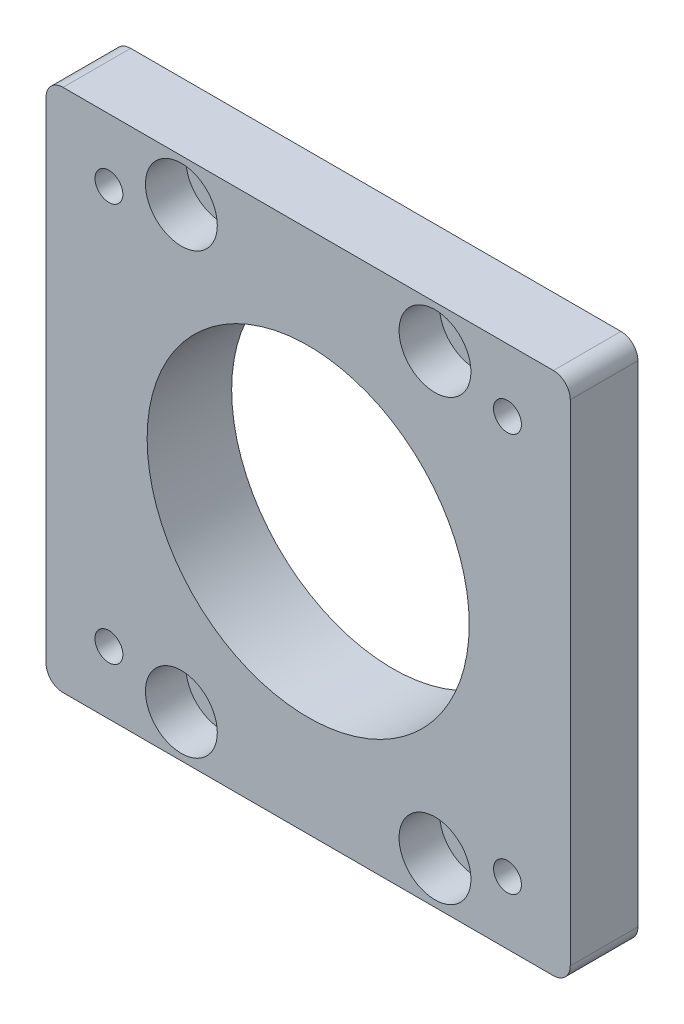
ISO-10303-21;
HEADER;
FILE_DESCRIPTION(('STEP AP214'),'2;1');
FILE_NAME('part.step','',(''),(''),'','','');
FILE_SCHEMA(('AUTOMOTIVE_DESIGN { 1 0 10303 214 1 1 1 1 }'));
ENDSEC;
DATA;
#1=APPLICATION_CONTEXT('core data for automotive mechanical design processes');
#2=APPLICATION_PROTOCOL_DEFINITION('international standard','automotive_design',2000,#1);
#3=PRODUCT_CONTEXT('',#1,'mechanical');
#4=PRODUCT('Part','Part','',(#3));
#5=PRODUCT_RELATED_PRODUCT_CATEGORY('part','',(#4));
#6=PRODUCT_DEFINITION_FORMATION('','',#4);
#7=PRODUCT_DEFINITION_CONTEXT('part definition',#1,'design');
#8=PRODUCT_DEFINITION('design','',#6,#7);
#9=PRODUCT_DEFINITION_SHAPE('','',#8);
#10=(LENGTH_UNIT() NAMED_UNIT(*) SI_UNIT(.MILLI.,.METRE.));
#11=(NAMED_UNIT(*) PLANE_ANGLE_UNIT() SI_UNIT($,.RADIAN.));
#12=(NAMED_UNIT(*) SI_UNIT($,.STERADIAN.) SOLID_ANGLE_UNIT());
#13=UNCERTAINTY_MEASURE_WITH_UNIT(LENGTH_MEASURE(1.E-05),#10,'distance_accuracy_value','');
#14=(GEOMETRIC_REPRESENTATION_CONTEXT(3) GLOBAL_UNCERTAINTY_ASSIGNED_CONTEXT((#13)) GLOBAL_UNIT_ASSIGNED_CONTEXT((#10,
#11,#12)) REPRESENTATION_CONTEXT('',''));
#15=CARTESIAN_POINT('',(0.,0.,0.));
#16=DIRECTION('',(0.,0.,1.));
#17=DIRECTION('',(1.,0.,0.));
#18=AXIS2_PLACEMENT_3D('',#15,#16,#17);
#19=CARTESIAN_POINT('',(0.,0.,0.));
#20=DIRECTION('',(0.,0.,-1.));
#21=DIRECTION('',(-1.,0.,0.));
#22=AXIS2_PLACEMENT_3D('',#19,#20,#21);
#23=PLANE('',#22);
#24=CARTESIAN_POINT('',(-23.5714045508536,23.5714045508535,0.));
#25=DIRECTION('',(0.,0.,-1.));
#26=DIRECTION('',(-1.,0.,0.));
#27=AXIS2_PLACEMENT_3D('',#24,#25,#26);
#28=CIRCLE('',#27,1.64999999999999);
#29=CARTESIAN_POINT('',(-25.2214045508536,23.5714045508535,0.));
#30=VERTEX_POINT('',#29);
#31=EDGE_CURVE('E452',#30,#30,#28,.T.);
#32=ORIENTED_EDGE('',*,*,#31,.F.);
#33=EDGE_LOOP('',(#32));
#34=FACE_BOUND('',#33,.T.);
#35=CARTESIAN_POINT('',(-23.5714045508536,-23.5714045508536,0.));
#36=DIRECTION('',(0.,0.,-1.));
#37=DIRECTION('',(-1.,0.,0.));
#38=AXIS2_PLACEMENT_3D('',#35,#36,#37);
#39=CIRCLE('',#38,1.64999999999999);
#40=CARTESIAN_POINT('',(-25.2214045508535,-23.5714045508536,0.));
#41=VERTEX_POINT('',#40);
#42=EDGE_CURVE('E44',#41,#41,#39,.T.);
#43=ORIENTED_EDGE('',*,*,#42,.F.);
#44=EDGE_LOOP('',(#43));
#45=FACE_BOUND('',#44,.T.);
#46=CARTESIAN_POINT('',(23.5714045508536,-23.5714045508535,0.));
#47=DIRECTION('',(0.,0.,-1.));
#48=DIRECTION('',(-1.,0.,0.));
#49=AXIS2_PLACEMENT_3D('',#46,#47,#48);
#50=CIRCLE('',#49,1.64999999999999);
#51=CARTESIAN_POINT('',(21.9214045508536,-23.5714045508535,0.));
#52=VERTEX_POINT('',#51);
#53=EDGE_CURVE('E207',#52,#52,#50,.T.);
#54=ORIENTED_EDGE('',*,*,#53,.F.);
#55=EDGE_LOOP('',(#54));
#56=FACE_BOUND('',#55,.T.);
#57=CARTESIAN_POINT('',(23.5714045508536,23.5714045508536,0.));
#58=DIRECTION('',(0.,0.,-1.));
#59=DIRECTION('',(-1.,0.,0.));
#60=AXIS2_PLACEMENT_3D('',#57,#58,#59);
#61=CIRCLE('',#60,1.64999999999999);
#62=CARTESIAN_POINT('',(21.9214045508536,23.5714045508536,0.));
#63=VERTEX_POINT('',#62);
#64=EDGE_CURVE('E217',#63,#63,#61,.T.);
#65=ORIENTED_EDGE('',*,*,#64,.F.);
#66=EDGE_LOOP('',(#65));
#67=FACE_BOUND('',#66,.T.);
#68=DIRECTION('',(0.,-1.,0.));
#69=VECTOR('',#68,1.);
#70=CARTESIAN_POINT('',(-31.,-31.,0.));
#71=LINE('',#70,#69);
#72=CARTESIAN_POINT('',(-31.,29.,0.));
#73=VERTEX_POINT('',#72);
#74=CARTESIAN_POINT('',(-31.,-29.,0.));
#75=VERTEX_POINT('',#74);
#76=EDGE_CURVE('E128',#73,#75,#71,.T.);
#77=ORIENTED_EDGE('',*,*,#76,.F.);
#78=CARTESIAN_POINT('',(-29.,29.,0.));
#79=DIRECTION('',(0.,0.,-1.));
#80=DIRECTION('',(-1.,0.,0.));
#81=AXIS2_PLACEMENT_3D('',#78,#79,#80);
#82=CIRCLE('',#81,2.);
#83=CARTESIAN_POINT('',(-29.,31.,0.));
#84=VERTEX_POINT('',#83);
#85=EDGE_CURVE('E110',#73,#84,#82,.T.);
#86=ORIENTED_EDGE('',*,*,#85,.T.);
#87=DIRECTION('',(-1.,0.,0.));
#88=VECTOR('',#87,1.);
#89=CARTESIAN_POINT('',(-31.,31.,0.));
#90=LINE('',#89,#88);
#91=CARTESIAN_POINT('',(29.,31.,0.));
#92=VERTEX_POINT('',#91);
#93=EDGE_CURVE('E139',#92,#84,#90,.T.);
#94=ORIENTED_EDGE('',*,*,#93,.F.);
#95=CARTESIAN_POINT('',(29.,29.,0.));
#96=DIRECTION('',(0.,0.,-1.));
#97=DIRECTION('',(-1.,0.,0.));
#98=AXIS2_PLACEMENT_3D('',#95,#96,#97);
#99=CIRCLE('',#98,2.);
#100=CARTESIAN_POINT('',(31.,29.,0.));
#101=VERTEX_POINT('',#100);
#102=EDGE_CURVE('E132',#92,#101,#99,.T.);
#103=ORIENTED_EDGE('',*,*,#102,.T.);
#104=DIRECTION('',(0.,1.,0.));
#105=VECTOR('',#104,1.);
#106=CARTESIAN_POINT('',(31.,-31.,0.));
#107=LINE('',#106,#105);
#108=CARTESIAN_POINT('',(31.,-29.,0.));
#109=VERTEX_POINT('',#108);
#110=EDGE_CURVE('E147',#109,#101,#107,.T.);
#111=ORIENTED_EDGE('',*,*,#110,.F.);
#112=CARTESIAN_POINT('',(29.,-29.,0.));
#113=DIRECTION('',(0.,0.,-1.));
#114=DIRECTION('',(-1.,0.,0.));
#115=AXIS2_PLACEMENT_3D('',#112,#113,#114);
#116=CIRCLE('',#115,2.);
#117=CARTESIAN_POINT('',(29.,-31.,0.));
#118=VERTEX_POINT('',#117);
#119=EDGE_CURVE('E179',#109,#118,#116,.T.);
#120=ORIENTED_EDGE('',*,*,#119,.T.);
#121=DIRECTION('',(1.,0.,0.));
#122=VECTOR('',#121,1.);
#123=CARTESIAN_POINT('',(-31.,-31.,0.));
#124=LINE('',#123,#122);
#125=CARTESIAN_POINT('',(-29.,-31.,0.));
#126=VERTEX_POINT('',#125);
#127=EDGE_CURVE('E138',#126,#118,#124,.T.);
#128=ORIENTED_EDGE('',*,*,#127,.F.);
#129=CARTESIAN_POINT('',(-29.,-29.,0.));
#130=DIRECTION('',(0.,0.,-1.));
#131=DIRECTION('',(-1.,0.,0.));
#132=AXIS2_PLACEMENT_3D('',#129,#130,#131);
#133=CIRCLE('',#132,2.);
#134=EDGE_CURVE('E122',#126,#75,#133,.T.);
#135=ORIENTED_EDGE('',*,*,#134,.T.);
#136=EDGE_LOOP('',(#77,#86,#94,#103,#111,#120,#128,#135));
#137=FACE_BOUND('',#136,.T.);
#138=CARTESIAN_POINT('',(-15.,25.9807621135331,0.));
#139=DIRECTION('',(0.,0.,1.));
#140=DIRECTION('',(1.,0.,0.));
#141=AXIS2_PLACEMENT_3D('',#138,#139,#140);
#142=CIRCLE('',#141,2.25);
#143=CARTESIAN_POINT('',(-12.75,25.9807621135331,0.));
#144=VERTEX_POINT('',#143);
#145=EDGE_CURVE('E279',#144,#144,#142,.T.);
#146=ORIENTED_EDGE('',*,*,#145,.T.);
#147=EDGE_LOOP('',(#146));
#148=FACE_BOUND('',#147,.T.);
#149=CARTESIAN_POINT('',(15.,25.9807621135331,0.));
#150=DIRECTION('',(0.,0.,1.));
#151=DIRECTION('',(1.,0.,0.));
#152=AXIS2_PLACEMENT_3D('',#149,#150,#151);
#153=CIRCLE('',#152,2.25);
#154=CARTESIAN_POINT('',(17.25,25.9807621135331,0.));
#155=VERTEX_POINT('',#154);
#156=EDGE_CURVE('E275',#155,#155,#153,.T.);
#157=ORIENTED_EDGE('',*,*,#156,.T.);
#158=EDGE_LOOP('',(#157));
#159=FACE_BOUND('',#158,.T.);
#160=CARTESIAN_POINT('',(15.,-25.9807621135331,0.));
#161=DIRECTION('',(0.,0.,1.));
#162=DIRECTION('',(1.,0.,0.));
#163=AXIS2_PLACEMENT_3D('',#160,#161,#162);
#164=CIRCLE('',#163,2.25);
#165=CARTESIAN_POINT('',(17.25,-25.9807621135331,0.));
#166=VERTEX_POINT('',#165);
#167=EDGE_CURVE('E271',#166,#166,#164,.T.);
#168=ORIENTED_EDGE('',*,*,#167,.T.);
#169=EDGE_LOOP('',(#168));
#170=FACE_BOUND('',#169,.T.);
#171=CARTESIAN_POINT('',(-15.,-25.9807621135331,0.));
#172=DIRECTION('',(0.,0.,1.));
#173=DIRECTION('',(1.,0.,0.));
#174=AXIS2_PLACEMENT_3D('',#171,#172,#173);
#175=CIRCLE('',#174,2.25);
#176=CARTESIAN_POINT('',(-12.75,-25.9807621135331,0.));
#177=VERTEX_POINT('',#176);
#178=EDGE_CURVE('E155',#177,#177,#175,.T.);
#179=ORIENTED_EDGE('',*,*,#178,.T.);
#180=EDGE_LOOP('',(#179));
#181=FACE_BOUND('',#180,.T.);
#182=CARTESIAN_POINT('',(0.,0.,0.));
#183=DIRECTION('',(0.,0.,-1.));
#184=DIRECTION('',(-1.,0.,0.));
#185=AXIS2_PLACEMENT_3D('',#182,#183,#184);
#186=CIRCLE('',#185,25.);
#187=CARTESIAN_POINT('',(-25.,0.,0.));
#188=VERTEX_POINT('',#187);
#189=EDGE_CURVE('E236',#188,#188,#186,.T.);
#190=ORIENTED_EDGE('',*,*,#189,.F.);
#191=EDGE_LOOP('',(#190));
#192=FACE_BOUND('',#191,.T.);
#193=ADVANCED_FACE('F40',(#34,#45,#56,#67,#137,#148,#159,#170,#181,#192),#23,.T.);
#194=CARTESIAN_POINT('',(-15.,-25.9807621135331,0.));
#195=DIRECTION('',(0.,0.,1.));
#196=DIRECTION('',(1.,0.,0.));
#197=AXIS2_PLACEMENT_3D('',#194,#195,#196);
#198=CYLINDRICAL_SURFACE('',#197,2.25);
#199=ORIENTED_EDGE('',*,*,#178,.F.);
#200=EDGE_LOOP('',(#199));
#201=FACE_BOUND('',#200,.T.);
#202=CARTESIAN_POINT('',(-15.,-25.9807621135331,3.2));
#203=DIRECTION('',(0.,0.,1.));
#204=DIRECTION('',(1.,0.,0.));
#205=AXIS2_PLACEMENT_3D('',#202,#203,#204);
#206=CIRCLE('',#205,2.25);
#207=CARTESIAN_POINT('',(-12.75,-25.9807621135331,3.2));
#208=VERTEX_POINT('',#207);
#209=EDGE_CURVE('E169',#208,#208,#206,.F.);
#210=ORIENTED_EDGE('',*,*,#209,.F.);
#211=EDGE_LOOP('',(#210));
#212=FACE_BOUND('',#211,.T.);
#213=ADVANCED_FACE('F323',(#201,#212),#198,.F.);
#214=CARTESIAN_POINT('',(15.,-25.9807621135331,0.));
#215=DIRECTION('',(0.,0.,1.));
#216=DIRECTION('',(1.,0.,0.));
#217=AXIS2_PLACEMENT_3D('',#214,#215,#216);
#218=CYLINDRICAL_SURFACE('',#217,2.25);
#219=ORIENTED_EDGE('',*,*,#167,.F.);
#220=EDGE_LOOP('',(#219));
#221=FACE_BOUND('',#220,.T.);
#222=CARTESIAN_POINT('',(15.,-25.9807621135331,3.2));
#223=DIRECTION('',(0.,0.,1.));
#224=DIRECTION('',(1.,0.,0.));
#225=AXIS2_PLACEMENT_3D('',#222,#223,#224);
#226=CIRCLE('',#225,2.25);
#227=CARTESIAN_POINT('',(17.25,-25.9807621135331,3.2));
#228=VERTEX_POINT('',#227);
#229=EDGE_CURVE('E163',#228,#228,#226,.F.);
#230=ORIENTED_EDGE('',*,*,#229,.F.);
#231=EDGE_LOOP('',(#230));
#232=FACE_BOUND('',#231,.T.);
#233=ADVANCED_FACE('F329',(#221,#232),#218,.F.);
#234=CARTESIAN_POINT('',(15.,25.9807621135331,0.));
#235=DIRECTION('',(0.,0.,1.));
#236=DIRECTION('',(1.,0.,0.));
#237=AXIS2_PLACEMENT_3D('',#234,#235,#236);
#238=CYLINDRICAL_SURFACE('',#237,2.25);
#239=ORIENTED_EDGE('',*,*,#156,.F.);
#240=EDGE_LOOP('',(#239));
#241=FACE_BOUND('',#240,.T.);
#242=CARTESIAN_POINT('',(15.,25.9807621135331,3.2));
#243=DIRECTION('',(0.,0.,1.));
#244=DIRECTION('',(1.,0.,0.));
#245=AXIS2_PLACEMENT_3D('',#242,#243,#244);
#246=CIRCLE('',#245,2.25);
#247=CARTESIAN_POINT('',(17.25,25.9807621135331,3.2));
#248=VERTEX_POINT('',#247);
#249=EDGE_CURVE('E157',#248,#248,#246,.F.);
#250=ORIENTED_EDGE('',*,*,#249,.F.);
#251=EDGE_LOOP('',(#250));
#252=FACE_BOUND('',#251,.T.);
#253=ADVANCED_FACE('F398',(#241,#252),#238,.F.);
#254=CARTESIAN_POINT('',(-15.,25.9807621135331,0.));
#255=DIRECTION('',(0.,0.,1.));
#256=DIRECTION('',(1.,0.,0.));
#257=AXIS2_PLACEMENT_3D('',#254,#255,#256);
#258=CYLINDRICAL_SURFACE('',#257,2.25);
#259=ORIENTED_EDGE('',*,*,#145,.F.);
#260=EDGE_LOOP('',(#259));
#261=FACE_BOUND('',#260,.T.);
#262=CARTESIAN_POINT('',(-15.,25.9807621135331,3.2));
#263=DIRECTION('',(0.,0.,1.));
#264=DIRECTION('',(1.,0.,0.));
#265=AXIS2_PLACEMENT_3D('',#262,#263,#264);
#266=CIRCLE('',#265,2.25);
#267=CARTESIAN_POINT('',(-12.75,25.9807621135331,3.2));
#268=VERTEX_POINT('',#267);
#269=EDGE_CURVE('E151',#268,#268,#266,.F.);
#270=ORIENTED_EDGE('',*,*,#269,.F.);
#271=EDGE_LOOP('',(#270));
#272=FACE_BOUND('',#271,.T.);
#273=ADVANCED_FACE('F402',(#261,#272),#258,.F.);
#274=CARTESIAN_POINT('',(0.,0.,8.));
#275=DIRECTION('',(0.,0.,-1.));
#276=DIRECTION('',(-1.,0.,0.));
#277=AXIS2_PLACEMENT_3D('',#274,#275,#276);
#278=PLANE('',#277);
#279=CARTESIAN_POINT('',(-23.5714045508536,23.5714045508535,8.));
#280=DIRECTION('',(0.,0.,1.));
#281=DIRECTION('',(1.,0.,0.));
#282=AXIS2_PLACEMENT_3D('',#279,#280,#281);
#283=CIRCLE('',#282,1.64999999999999);
#284=CARTESIAN_POINT('',(-21.9214045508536,23.5714045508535,8.));
#285=VERTEX_POINT('',#284);
#286=EDGE_CURVE('E455',#285,#285,#283,.T.);
#287=ORIENTED_EDGE('',*,*,#286,.F.);
#288=EDGE_LOOP('',(#287));
#289=FACE_BOUND('',#288,.T.);
#290=CARTESIAN_POINT('',(-23.5714045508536,-23.5714045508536,8.));
#291=DIRECTION('',(0.,0.,1.));
#292=DIRECTION('',(1.,0.,0.));
#293=AXIS2_PLACEMENT_3D('',#290,#291,#292);
#294=CIRCLE('',#293,1.64999999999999);
#295=CARTESIAN_POINT('',(-21.9214045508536,-23.5714045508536,8.));
#296=VERTEX_POINT('',#295);
#297=EDGE_CURVE('E226',#296,#296,#294,.T.);
#298=ORIENTED_EDGE('',*,*,#297,.F.);
#299=EDGE_LOOP('',(#298));
#300=FACE_BOUND('',#299,.T.);
#301=CARTESIAN_POINT('',(23.5714045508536,-23.5714045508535,8.));
#302=DIRECTION('',(0.,0.,1.));
#303=DIRECTION('',(1.,0.,0.));
#304=AXIS2_PLACEMENT_3D('',#301,#302,#303);
#305=CIRCLE('',#304,1.64999999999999);
#306=CARTESIAN_POINT('',(25.2214045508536,-23.5714045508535,8.));
#307=VERTEX_POINT('',#306);
#308=EDGE_CURVE('E211',#307,#307,#305,.T.);
#309=ORIENTED_EDGE('',*,*,#308,.F.);
#310=EDGE_LOOP('',(#309));
#311=FACE_BOUND('',#310,.T.);
#312=CARTESIAN_POINT('',(23.5714045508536,23.5714045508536,8.));
#313=DIRECTION('',(0.,0.,1.));
#314=DIRECTION('',(1.,0.,0.));
#315=AXIS2_PLACEMENT_3D('',#312,#313,#314);
#316=CIRCLE('',#315,1.64999999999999);
#317=CARTESIAN_POINT('',(25.2214045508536,23.5714045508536,8.));
#318=VERTEX_POINT('',#317);
#319=EDGE_CURVE('E210',#318,#318,#316,.T.);
#320=ORIENTED_EDGE('',*,*,#319,.F.);
#321=EDGE_LOOP('',(#320));
#322=FACE_BOUND('',#321,.T.);
#323=CARTESIAN_POINT('',(-15.,-25.9807621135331,8.));
#324=DIRECTION('',(0.,0.,1.));
#325=DIRECTION('',(1.,0.,0.));
#326=AXIS2_PLACEMENT_3D('',#323,#324,#325);
#327=CIRCLE('',#326,4.25);
#328=CARTESIAN_POINT('',(-10.75,-25.9807621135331,8.));
#329=VERTEX_POINT('',#328);
#330=EDGE_CURVE('E241',#329,#329,#327,.T.);
#331=ORIENTED_EDGE('',*,*,#330,.F.);
#332=EDGE_LOOP('',(#331));
#333=FACE_BOUND('',#332,.T.);
#334=CARTESIAN_POINT('',(15.,-25.9807621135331,8.));
#335=DIRECTION('',(0.,0.,1.));
#336=DIRECTION('',(1.,0.,0.));
#337=AXIS2_PLACEMENT_3D('',#334,#335,#336);
#338=CIRCLE('',#337,4.25);
#339=CARTESIAN_POINT('',(19.25,-25.9807621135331,8.));
#340=VERTEX_POINT('',#339);
#341=EDGE_CURVE('E173',#340,#340,#338,.T.);
#342=ORIENTED_EDGE('',*,*,#341,.F.);
#343=EDGE_LOOP('',(#342));
#344=FACE_BOUND('',#343,.T.);
#345=CARTESIAN_POINT('',(15.,25.9807621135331,8.));
#346=DIRECTION('',(0.,0.,1.));
#347=DIRECTION('',(1.,0.,0.));
#348=AXIS2_PLACEMENT_3D('',#345,#346,#347);
#349=CIRCLE('',#348,4.25);
#350=CARTESIAN_POINT('',(19.25,25.9807621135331,8.));
#351=VERTEX_POINT('',#350);
#352=EDGE_CURVE('E167',#351,#351,#349,.T.);
#353=ORIENTED_EDGE('',*,*,#352,.F.);
#354=EDGE_LOOP('',(#353));
#355=FACE_BOUND('',#354,.T.);
#356=CARTESIAN_POINT('',(-15.,25.9807621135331,8.));
#357=DIRECTION('',(0.,0.,1.));
#358=DIRECTION('',(1.,0.,0.));
#359=AXIS2_PLACEMENT_3D('',#356,#357,#358);
#360=CIRCLE('',#359,4.25);
#361=CARTESIAN_POINT('',(-10.75,25.9807621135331,8.));
#362=VERTEX_POINT('',#361);
#363=EDGE_CURVE('E161',#362,#362,#360,.T.);
#364=ORIENTED_EDGE('',*,*,#363,.F.);
#365=EDGE_LOOP('',(#364));
#366=FACE_BOUND('',#365,.T.);
#367=DIRECTION('',(-1.,0.,0.));
#368=VECTOR('',#367,1.);
#369=CARTESIAN_POINT('',(-31.,31.,8.));
#370=LINE('',#369,#368);
#371=CARTESIAN_POINT('',(29.,31.,8.));
#372=VERTEX_POINT('',#371);
#373=CARTESIAN_POINT('',(-29.,31.,8.));
#374=VERTEX_POINT('',#373);
#375=EDGE_CURVE('E290',#372,#374,#370,.T.);
#376=ORIENTED_EDGE('',*,*,#375,.T.);
#377=CARTESIAN_POINT('',(-29.,29.,8.));
#378=DIRECTION('',(0.,0.,-1.));
#379=DIRECTION('',(-1.,0.,0.));
#380=AXIS2_PLACEMENT_3D('',#377,#378,#379);
#381=CIRCLE('',#380,2.);
#382=CARTESIAN_POINT('',(-31.,29.,8.));
#383=VERTEX_POINT('',#382);
#384=EDGE_CURVE('E197',#374,#383,#381,.F.);
#385=ORIENTED_EDGE('',*,*,#384,.T.);
#386=DIRECTION('',(0.,-1.,0.));
#387=VECTOR('',#386,1.);
#388=CARTESIAN_POINT('',(-31.,-31.,8.));
#389=LINE('',#388,#387);
#390=CARTESIAN_POINT('',(-31.,-29.,8.));
#391=VERTEX_POINT('',#390);
#392=EDGE_CURVE('E130',#383,#391,#389,.T.);
#393=ORIENTED_EDGE('',*,*,#392,.T.);
#394=CARTESIAN_POINT('',(-29.,-29.,8.));
#395=DIRECTION('',(0.,0.,-1.));
#396=DIRECTION('',(-1.,0.,0.));
#397=AXIS2_PLACEMENT_3D('',#394,#395,#396);
#398=CIRCLE('',#397,2.);
#399=CARTESIAN_POINT('',(-29.,-31.,8.));
#400=VERTEX_POINT('',#399);
#401=EDGE_CURVE('E65',#391,#400,#398,.F.);
#402=ORIENTED_EDGE('',*,*,#401,.T.);
#403=DIRECTION('',(1.,0.,0.));
#404=VECTOR('',#403,1.);
#405=CARTESIAN_POINT('',(-31.,-31.,8.));
#406=LINE('',#405,#404);
#407=CARTESIAN_POINT('',(29.,-31.,8.));
#408=VERTEX_POINT('',#407);
#409=EDGE_CURVE('E176',#400,#408,#406,.T.);
#410=ORIENTED_EDGE('',*,*,#409,.T.);
#411=CARTESIAN_POINT('',(29.,-29.,8.));
#412=DIRECTION('',(0.,0.,-1.));
#413=DIRECTION('',(-1.,0.,0.));
#414=AXIS2_PLACEMENT_3D('',#411,#412,#413);
#415=CIRCLE('',#414,2.);
#416=CARTESIAN_POINT('',(31.,-29.,8.));
#417=VERTEX_POINT('',#416);
#418=EDGE_CURVE('E192',#408,#417,#415,.F.);
#419=ORIENTED_EDGE('',*,*,#418,.T.);
#420=DIRECTION('',(0.,1.,0.));
#421=VECTOR('',#420,1.);
#422=CARTESIAN_POINT('',(31.,-31.,8.));
#423=LINE('',#422,#421);
#424=CARTESIAN_POINT('',(31.,29.,8.));
#425=VERTEX_POINT('',#424);
#426=EDGE_CURVE('E144',#417,#425,#423,.T.);
#427=ORIENTED_EDGE('',*,*,#426,.T.);
#428=CARTESIAN_POINT('',(29.,29.,8.));
#429=DIRECTION('',(0.,0.,-1.));
#430=DIRECTION('',(-1.,0.,0.));
#431=AXIS2_PLACEMENT_3D('',#428,#429,#430);
#432=CIRCLE('',#431,2.);
#433=EDGE_CURVE('E189',#425,#372,#432,.F.);
#434=ORIENTED_EDGE('',*,*,#433,.T.);
#435=EDGE_LOOP('',(#376,#385,#393,#402,#410,#419,#427,#434));
#436=FACE_BOUND('',#435,.T.);
#437=CARTESIAN_POINT('',(0.,0.,8.));
#438=DIRECTION('',(0.,0.,1.));
#439=DIRECTION('',(1.,0.,0.));
#440=AXIS2_PLACEMENT_3D('',#437,#438,#439);
#441=CIRCLE('',#440,19.05);
#442=CARTESIAN_POINT('',(19.05,0.,8.));
#443=VERTEX_POINT('',#442);
#444=EDGE_CURVE('E283',#443,#443,#441,.T.);
#445=ORIENTED_EDGE('',*,*,#444,.F.);
#446=EDGE_LOOP('',(#445));
#447=FACE_BOUND('',#446,.T.);
#448=ADVANCED_FACE('F309',(#289,#300,#311,#322,#333,#344,#355,#366,#436,#447),#278,.F.);
#449=CARTESIAN_POINT('',(31.,-31.,8.));
#450=DIRECTION('',(-1.,0.,0.));
#451=DIRECTION('',(0.,0.,1.));
#452=AXIS2_PLACEMENT_3D('',#449,#450,#451);
#453=PLANE('',#452);
#454=ORIENTED_EDGE('',*,*,#426,.F.);
#455=DIRECTION('',(0.,0.,-1.));
#456=VECTOR('',#455,1.);
#457=CARTESIAN_POINT('',(31.,-29.,8.));
#458=LINE('',#457,#456);
#459=EDGE_CURVE('E11',#417,#109,#458,.T.);
#460=ORIENTED_EDGE('',*,*,#459,.T.);
#461=ORIENTED_EDGE('',*,*,#110,.T.);
#462=DIRECTION('',(0.,0.,-1.));
#463=VECTOR('',#462,1.);
#464=CARTESIAN_POINT('',(31.,29.,8.));
#465=LINE('',#464,#463);
#466=EDGE_CURVE('E50',#101,#425,#465,.F.);
#467=ORIENTED_EDGE('',*,*,#466,.T.);
#468=EDGE_LOOP('',(#454,#460,#461,#467));
#469=FACE_BOUND('',#468,.T.);
#470=ADVANCED_FACE('F303',(#469),#453,.F.);
#471=CARTESIAN_POINT('',(-31.,31.,8.));
#472=DIRECTION('',(0.,-1.,0.));
#473=DIRECTION('',(0.,0.,-1.));
#474=AXIS2_PLACEMENT_3D('',#471,#472,#473);
#475=PLANE('',#474);
#476=ORIENTED_EDGE('',*,*,#93,.T.);
#477=DIRECTION('',(0.,0.,-1.));
#478=VECTOR('',#477,1.);
#479=CARTESIAN_POINT('',(-29.,31.,8.));
#480=LINE('',#479,#478);
#481=EDGE_CURVE('E115',#84,#374,#480,.F.);
#482=ORIENTED_EDGE('',*,*,#481,.T.);
#483=ORIENTED_EDGE('',*,*,#375,.F.);
#484=DIRECTION('',(0.,0.,-1.));
#485=VECTOR('',#484,1.);
#486=CARTESIAN_POINT('',(29.,31.,8.));
#487=LINE('',#486,#485);
#488=EDGE_CURVE('E121',#372,#92,#487,.T.);
#489=ORIENTED_EDGE('',*,*,#488,.T.);
#490=EDGE_LOOP('',(#476,#482,#483,#489));
#491=FACE_BOUND('',#490,.T.);
#492=ADVANCED_FACE('F312',(#491),#475,.F.);
#493=CARTESIAN_POINT('',(-31.,-31.,8.));
#494=DIRECTION('',(1.,0.,0.));
#495=DIRECTION('',(0.,0.,-1.));
#496=AXIS2_PLACEMENT_3D('',#493,#494,#495);
#497=PLANE('',#496);
#498=ORIENTED_EDGE('',*,*,#392,.F.);
#499=DIRECTION('',(0.,0.,-1.));
#500=VECTOR('',#499,1.);
#501=CARTESIAN_POINT('',(-31.,29.,8.));
#502=LINE('',#501,#500);
#503=EDGE_CURVE('E114',#383,#73,#502,.T.);
#504=ORIENTED_EDGE('',*,*,#503,.T.);
#505=ORIENTED_EDGE('',*,*,#76,.T.);
#506=DIRECTION('',(0.,0.,-1.));
#507=VECTOR('',#506,1.);
#508=CARTESIAN_POINT('',(-31.,-29.,8.));
#509=LINE('',#508,#507);
#510=EDGE_CURVE('E133',#75,#391,#509,.F.);
#511=ORIENTED_EDGE('',*,*,#510,.T.);
#512=EDGE_LOOP('',(#498,#504,#505,#511));
#513=FACE_BOUND('',#512,.T.);
#514=ADVANCED_FACE('F127',(#513),#497,.F.);
#515=CARTESIAN_POINT('',(-31.,-31.,8.));
#516=DIRECTION('',(0.,1.,0.));
#517=DIRECTION('',(0.,0.,1.));
#518=AXIS2_PLACEMENT_3D('',#515,#516,#517);
#519=PLANE('',#518);
#520=ORIENTED_EDGE('',*,*,#409,.F.);
#521=DIRECTION('',(0.,0.,-1.));
#522=VECTOR('',#521,1.);
#523=CARTESIAN_POINT('',(-29.,-31.,8.));
#524=LINE('',#523,#522);
#525=EDGE_CURVE('E202',#400,#126,#524,.T.);
#526=ORIENTED_EDGE('',*,*,#525,.T.);
#527=ORIENTED_EDGE('',*,*,#127,.T.);
#528=DIRECTION('',(0.,0.,-1.));
#529=VECTOR('',#528,1.);
#530=CARTESIAN_POINT('',(29.,-31.,8.));
#531=LINE('',#530,#529);
#532=EDGE_CURVE('E58',#118,#408,#531,.F.);
#533=ORIENTED_EDGE('',*,*,#532,.T.);
#534=EDGE_LOOP('',(#520,#526,#527,#533));
#535=FACE_BOUND('',#534,.T.);
#536=ADVANCED_FACE('F319',(#535),#519,.F.);
#537=CARTESIAN_POINT('',(0.,0.,8.));
#538=DIRECTION('',(0.,0.,-1.));
#539=DIRECTION('',(-1.,0.,0.));
#540=AXIS2_PLACEMENT_3D('',#537,#538,#539);
#541=CYLINDRICAL_SURFACE('',#540,19.05);
#542=ORIENTED_EDGE('',*,*,#444,.T.);
#543=EDGE_LOOP('',(#542));
#544=FACE_BOUND('',#543,.T.);
#545=CARTESIAN_POINT('',(0.,0.,-2.));
#546=DIRECTION('',(0.,0.,-1.));
#547=DIRECTION('',(-1.,0.,0.));
#548=AXIS2_PLACEMENT_3D('',#545,#546,#547);
#549=CIRCLE('',#548,19.05);
#550=CARTESIAN_POINT('',(-19.05,0.,-2.));
#551=VERTEX_POINT('',#550);
#552=EDGE_CURVE('E232',#551,#551,#549,.T.);
#553=ORIENTED_EDGE('',*,*,#552,.T.);
#554=EDGE_LOOP('',(#553));
#555=FACE_BOUND('',#554,.T.);
#556=ADVANCED_FACE('F338',(#544,#555),#541,.F.);
#557=CARTESIAN_POINT('',(-15.,25.9807621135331,3.2));
#558=DIRECTION('',(0.,0.,1.));
#559=DIRECTION('',(1.,0.,0.));
#560=AXIS2_PLACEMENT_3D('',#557,#558,#559);
#561=PLANE('',#560);
#562=CARTESIAN_POINT('',(-15.,25.9807621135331,3.2));
#563=DIRECTION('',(0.,0.,1.));
#564=DIRECTION('',(1.,0.,0.));
#565=AXIS2_PLACEMENT_3D('',#562,#563,#564);
#566=CIRCLE('',#565,4.25);
#567=CARTESIAN_POINT('',(-10.75,25.9807621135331,3.2));
#568=VERTEX_POINT('',#567);
#569=EDGE_CURVE('E156',#568,#568,#566,.T.);
#570=ORIENTED_EDGE('',*,*,#569,.T.);
#571=EDGE_LOOP('',(#570));
#572=FACE_BOUND('',#571,.T.);
#573=ORIENTED_EDGE('',*,*,#269,.T.);
#574=EDGE_LOOP('',(#573));
#575=FACE_BOUND('',#574,.T.);
#576=ADVANCED_FACE('F342',(#572,#575),#561,.T.);
#577=CARTESIAN_POINT('',(-15.,25.9807621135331,3.2));
#578=DIRECTION('',(0.,0.,1.));
#579=DIRECTION('',(1.,0.,0.));
#580=AXIS2_PLACEMENT_3D('',#577,#578,#579);
#581=CYLINDRICAL_SURFACE('',#580,4.25);
#582=ORIENTED_EDGE('',*,*,#569,.F.);
#583=EDGE_LOOP('',(#582));
#584=FACE_BOUND('',#583,.T.);
#585=ORIENTED_EDGE('',*,*,#363,.T.);
#586=EDGE_LOOP('',(#585));
#587=FACE_BOUND('',#586,.T.);
#588=ADVANCED_FACE('F385',(#584,#587),#581,.F.);
#589=CARTESIAN_POINT('',(15.,25.9807621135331,3.2));
#590=DIRECTION('',(0.,0.,1.));
#591=DIRECTION('',(1.,0.,0.));
#592=AXIS2_PLACEMENT_3D('',#589,#590,#591);
#593=PLANE('',#592);
#594=CARTESIAN_POINT('',(15.,25.9807621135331,3.2));
#595=DIRECTION('',(0.,0.,1.));
#596=DIRECTION('',(1.,0.,0.));
#597=AXIS2_PLACEMENT_3D('',#594,#595,#596);
#598=CIRCLE('',#597,4.25);
#599=CARTESIAN_POINT('',(19.25,25.9807621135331,3.2));
#600=VERTEX_POINT('',#599);
#601=EDGE_CURVE('E162',#600,#600,#598,.T.);
#602=ORIENTED_EDGE('',*,*,#601,.T.);
#603=EDGE_LOOP('',(#602));
#604=FACE_BOUND('',#603,.T.);
#605=ORIENTED_EDGE('',*,*,#249,.T.);
#606=EDGE_LOOP('',(#605));
#607=FACE_BOUND('',#606,.T.);
#608=ADVANCED_FACE('F382',(#604,#607),#593,.T.);
#609=CARTESIAN_POINT('',(15.,25.9807621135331,3.2));
#610=DIRECTION('',(0.,0.,1.));
#611=DIRECTION('',(1.,0.,0.));
#612=AXIS2_PLACEMENT_3D('',#609,#610,#611);
#613=CYLINDRICAL_SURFACE('',#612,4.25);
#614=ORIENTED_EDGE('',*,*,#601,.F.);
#615=EDGE_LOOP('',(#614));
#616=FACE_BOUND('',#615,.T.);
#617=ORIENTED_EDGE('',*,*,#352,.T.);
#618=EDGE_LOOP('',(#617));
#619=FACE_BOUND('',#618,.T.);
#620=ADVANCED_FACE('F377',(#616,#619),#613,.F.);
#621=CARTESIAN_POINT('',(15.,-25.9807621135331,3.2));
#622=DIRECTION('',(0.,0.,1.));
#623=DIRECTION('',(1.,0.,0.));
#624=AXIS2_PLACEMENT_3D('',#621,#622,#623);
#625=PLANE('',#624);
#626=CARTESIAN_POINT('',(15.,-25.9807621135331,3.2));
#627=DIRECTION('',(0.,0.,1.));
#628=DIRECTION('',(1.,0.,0.));
#629=AXIS2_PLACEMENT_3D('',#626,#627,#628);
#630=CIRCLE('',#629,4.25);
#631=CARTESIAN_POINT('',(19.25,-25.9807621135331,3.2));
#632=VERTEX_POINT('',#631);
#633=EDGE_CURVE('E168',#632,#632,#630,.T.);
#634=ORIENTED_EDGE('',*,*,#633,.T.);
#635=EDGE_LOOP('',(#634));
#636=FACE_BOUND('',#635,.T.);
#637=ORIENTED_EDGE('',*,*,#229,.T.);
#638=EDGE_LOOP('',(#637));
#639=FACE_BOUND('',#638,.T.);
#640=ADVANCED_FACE('F374',(#636,#639),#625,.T.);
#641=CARTESIAN_POINT('',(15.,-25.9807621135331,3.2));
#642=DIRECTION('',(0.,0.,1.));
#643=DIRECTION('',(1.,0.,0.));
#644=AXIS2_PLACEMENT_3D('',#641,#642,#643);
#645=CYLINDRICAL_SURFACE('',#644,4.25);
#646=ORIENTED_EDGE('',*,*,#633,.F.);
#647=EDGE_LOOP('',(#646));
#648=FACE_BOUND('',#647,.T.);
#649=ORIENTED_EDGE('',*,*,#341,.T.);
#650=EDGE_LOOP('',(#649));
#651=FACE_BOUND('',#650,.T.);
#652=ADVANCED_FACE('F367',(#648,#651),#645,.F.);
#653=CARTESIAN_POINT('',(-15.,-25.9807621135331,3.2));
#654=DIRECTION('',(0.,0.,1.));
#655=DIRECTION('',(1.,0.,0.));
#656=AXIS2_PLACEMENT_3D('',#653,#654,#655);
#657=PLANE('',#656);
#658=CARTESIAN_POINT('',(-15.,-25.9807621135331,3.2));
#659=DIRECTION('',(0.,0.,1.));
#660=DIRECTION('',(1.,0.,0.));
#661=AXIS2_PLACEMENT_3D('',#658,#659,#660);
#662=CIRCLE('',#661,4.25);
#663=CARTESIAN_POINT('',(-10.75,-25.9807621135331,3.2));
#664=VERTEX_POINT('',#663);
#665=EDGE_CURVE('E174',#664,#664,#662,.T.);
#666=ORIENTED_EDGE('',*,*,#665,.T.);
#667=EDGE_LOOP('',(#666));
#668=FACE_BOUND('',#667,.T.);
#669=ORIENTED_EDGE('',*,*,#209,.T.);
#670=EDGE_LOOP('',(#669));
#671=FACE_BOUND('',#670,.T.);
#672=ADVANCED_FACE('F361',(#668,#671),#657,.T.);
#673=CARTESIAN_POINT('',(-15.,-25.9807621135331,3.2));
#674=DIRECTION('',(0.,0.,1.));
#675=DIRECTION('',(1.,0.,0.));
#676=AXIS2_PLACEMENT_3D('',#673,#674,#675);
#677=CYLINDRICAL_SURFACE('',#676,4.25);
#678=ORIENTED_EDGE('',*,*,#665,.F.);
#679=EDGE_LOOP('',(#678));
#680=FACE_BOUND('',#679,.T.);
#681=ORIENTED_EDGE('',*,*,#330,.T.);
#682=EDGE_LOOP('',(#681));
#683=FACE_BOUND('',#682,.T.);
#684=ADVANCED_FACE('F356',(#680,#683),#677,.F.);
#685=CARTESIAN_POINT('',(-29.,29.,8.));
#686=DIRECTION('',(0.,0.,-1.));
#687=DIRECTION('',(-1.,0.,0.));
#688=AXIS2_PLACEMENT_3D('',#685,#686,#687);
#689=CYLINDRICAL_SURFACE('',#688,2.);
#690=ORIENTED_EDGE('',*,*,#384,.F.);
#691=ORIENTED_EDGE('',*,*,#481,.F.);
#692=ORIENTED_EDGE('',*,*,#85,.F.);
#693=ORIENTED_EDGE('',*,*,#503,.F.);
#694=EDGE_LOOP('',(#690,#691,#692,#693));
#695=FACE_BOUND('',#694,.T.);
#696=ADVANCED_FACE('F113',(#695),#689,.T.);
#697=CARTESIAN_POINT('',(-29.,-29.,8.));
#698=DIRECTION('',(0.,0.,-1.));
#699=DIRECTION('',(-1.,0.,0.));
#700=AXIS2_PLACEMENT_3D('',#697,#698,#699);
#701=CYLINDRICAL_SURFACE('',#700,2.);
#702=ORIENTED_EDGE('',*,*,#401,.F.);
#703=ORIENTED_EDGE('',*,*,#510,.F.);
#704=ORIENTED_EDGE('',*,*,#134,.F.);
#705=ORIENTED_EDGE('',*,*,#525,.F.);
#706=EDGE_LOOP('',(#702,#703,#704,#705));
#707=FACE_BOUND('',#706,.T.);
#708=ADVANCED_FACE('F347',(#707),#701,.T.);
#709=CARTESIAN_POINT('',(29.,-29.,8.));
#710=DIRECTION('',(0.,0.,-1.));
#711=DIRECTION('',(-1.,0.,0.));
#712=AXIS2_PLACEMENT_3D('',#709,#710,#711);
#713=CYLINDRICAL_SURFACE('',#712,2.);
#714=ORIENTED_EDGE('',*,*,#418,.F.);
#715=ORIENTED_EDGE('',*,*,#532,.F.);
#716=ORIENTED_EDGE('',*,*,#119,.F.);
#717=ORIENTED_EDGE('',*,*,#459,.F.);
#718=EDGE_LOOP('',(#714,#715,#716,#717));
#719=FACE_BOUND('',#718,.T.);
#720=ADVANCED_FACE('F349',(#719),#713,.T.);
#721=CARTESIAN_POINT('',(29.,29.,8.));
#722=DIRECTION('',(0.,0.,-1.));
#723=DIRECTION('',(-1.,0.,0.));
#724=AXIS2_PLACEMENT_3D('',#721,#722,#723);
#725=CYLINDRICAL_SURFACE('',#724,2.);
#726=ORIENTED_EDGE('',*,*,#433,.F.);
#727=ORIENTED_EDGE('',*,*,#466,.F.);
#728=ORIENTED_EDGE('',*,*,#102,.F.);
#729=ORIENTED_EDGE('',*,*,#488,.F.);
#730=EDGE_LOOP('',(#726,#727,#728,#729));
#731=FACE_BOUND('',#730,.T.);
#732=ADVANCED_FACE('F42',(#731),#725,.T.);
#733=CARTESIAN_POINT('',(0.,0.,-2.));
#734=DIRECTION('',(0.,0.,-1.));
#735=DIRECTION('',(-1.,0.,0.));
#736=AXIS2_PLACEMENT_3D('',#733,#734,#735);
#737=PLANE('',#736);
#738=CARTESIAN_POINT('',(0.,0.,-2.));
#739=DIRECTION('',(0.,0.,-1.));
#740=DIRECTION('',(-1.,0.,0.));
#741=AXIS2_PLACEMENT_3D('',#738,#739,#740);
#742=CIRCLE('',#741,25.);
#743=CARTESIAN_POINT('',(-25.,0.,-2.));
#744=VERTEX_POINT('',#743);
#745=EDGE_CURVE('E237',#744,#744,#742,.T.);
#746=ORIENTED_EDGE('',*,*,#745,.T.);
#747=EDGE_LOOP('',(#746));
#748=FACE_BOUND('',#747,.T.);
#749=ORIENTED_EDGE('',*,*,#552,.F.);
#750=EDGE_LOOP('',(#749));
#751=FACE_BOUND('',#750,.T.);
#752=ADVANCED_FACE('F426',(#748,#751),#737,.T.);
#753=CARTESIAN_POINT('',(0.,0.,-2.));
#754=DIRECTION('',(0.,0.,1.));
#755=DIRECTION('',(1.,0.,0.));
#756=AXIS2_PLACEMENT_3D('',#753,#754,#755);
#757=CYLINDRICAL_SURFACE('',#756,25.);
#758=ORIENTED_EDGE('',*,*,#745,.F.);
#759=EDGE_LOOP('',(#758));
#760=FACE_BOUND('',#759,.T.);
#761=ORIENTED_EDGE('',*,*,#189,.T.);
#762=EDGE_LOOP('',(#761));
#763=FACE_BOUND('',#762,.T.);
#764=ADVANCED_FACE('F423',(#760,#763),#757,.T.);
#765=CARTESIAN_POINT('',(23.5714045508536,23.5714045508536,8.));
#766=DIRECTION('',(0.,0.,1.));
#767=DIRECTION('',(1.,0.,0.));
#768=AXIS2_PLACEMENT_3D('',#765,#766,#767);
#769=CYLINDRICAL_SURFACE('',#768,1.64999999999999);
#770=ORIENTED_EDGE('',*,*,#64,.T.);
#771=EDGE_LOOP('',(#770));
#772=FACE_BOUND('',#771,.T.);
#773=ORIENTED_EDGE('',*,*,#319,.T.);
#774=EDGE_LOOP('',(#773));
#775=FACE_BOUND('',#774,.T.);
#776=ADVANCED_FACE('F425',(#772,#775),#769,.F.);
#777=CARTESIAN_POINT('',(23.5714045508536,-23.5714045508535,8.));
#778=DIRECTION('',(0.,0.,1.));
#779=DIRECTION('',(1.,0.,0.));
#780=AXIS2_PLACEMENT_3D('',#777,#778,#779);
#781=CYLINDRICAL_SURFACE('',#780,1.64999999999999);
#782=ORIENTED_EDGE('',*,*,#53,.T.);
#783=EDGE_LOOP('',(#782));
#784=FACE_BOUND('',#783,.T.);
#785=ORIENTED_EDGE('',*,*,#308,.T.);
#786=EDGE_LOOP('',(#785));
#787=FACE_BOUND('',#786,.T.);
#788=ADVANCED_FACE('F432',(#784,#787),#781,.F.);
#789=CARTESIAN_POINT('',(-23.5714045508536,-23.5714045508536,8.));
#790=DIRECTION('',(0.,0.,1.));
#791=DIRECTION('',(1.,0.,0.));
#792=AXIS2_PLACEMENT_3D('',#789,#790,#791);
#793=CYLINDRICAL_SURFACE('',#792,1.64999999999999);
#794=ORIENTED_EDGE('',*,*,#42,.T.);
#795=EDGE_LOOP('',(#794));
#796=FACE_BOUND('',#795,.T.);
#797=ORIENTED_EDGE('',*,*,#297,.T.);
#798=EDGE_LOOP('',(#797));
#799=FACE_BOUND('',#798,.T.);
#800=ADVANCED_FACE('F441',(#796,#799),#793,.F.);
#801=CARTESIAN_POINT('',(-23.5714045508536,23.5714045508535,8.));
#802=DIRECTION('',(0.,0.,1.));
#803=DIRECTION('',(1.,0.,0.));
#804=AXIS2_PLACEMENT_3D('',#801,#802,#803);
#805=CYLINDRICAL_SURFACE('',#804,1.64999999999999);
#806=ORIENTED_EDGE('',*,*,#31,.T.);
#807=EDGE_LOOP('',(#806));
#808=FACE_BOUND('',#807,.T.);
#809=ORIENTED_EDGE('',*,*,#286,.T.);
#810=EDGE_LOOP('',(#809));
#811=FACE_BOUND('',#810,.T.);
#812=ADVANCED_FACE('F444',(#808,#811),#805,.F.);
#813=CLOSED_SHELL('',(#193,#213,#233,#253,#273,#448,#470,#492,#514,#536,#556,#576,#588,#608,
#620,#640,#652,#672,#684,#696,#708,#720,#732,#752,#764,#776,#788,#800,#812));
#814=MANIFOLD_SOLID_BREP('B2',#813);
#815=ADVANCED_BREP_SHAPE_REPRESENTATION('',(#18,#814),#14);
#816=SHAPE_DEFINITION_REPRESENTATION(#9,#815);
ENDSEC;
END-ISO-10303-21;
